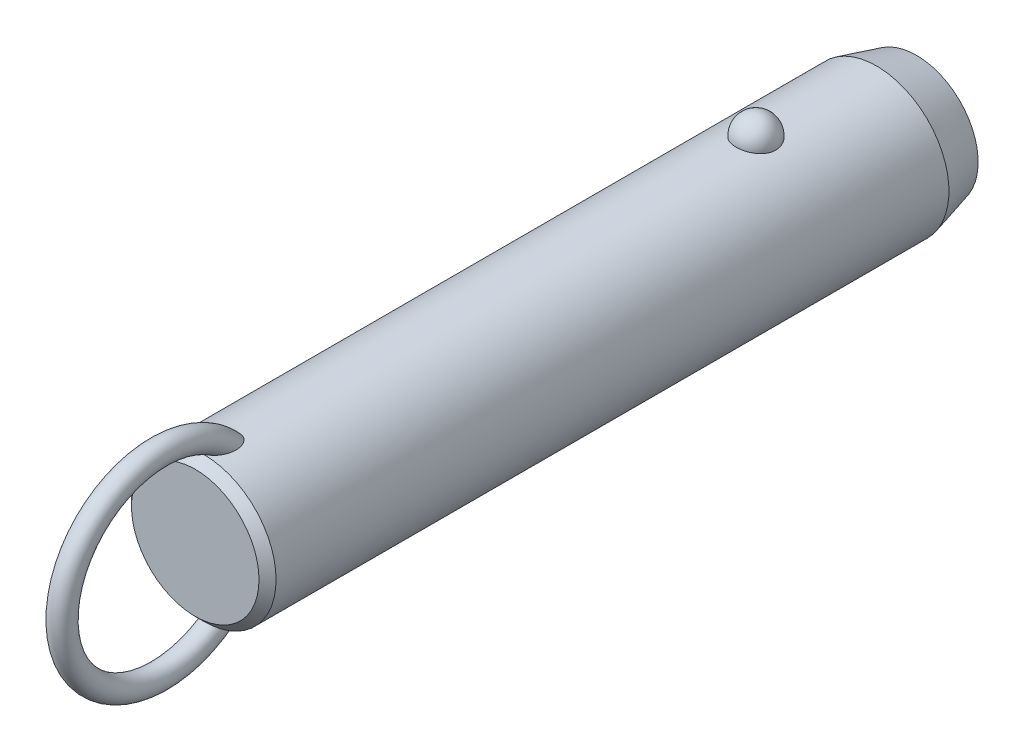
ISO-10303-21;
HEADER;
FILE_DESCRIPTION(('STEP AP214'),'2;1');
FILE_NAME('part.step','',(''),(''),'','','');
FILE_SCHEMA(('AUTOMOTIVE_DESIGN { 1 0 10303 214 1 1 1 1 }'));
ENDSEC;
DATA;
#1=APPLICATION_CONTEXT('core data for automotive mechanical design processes');
#2=APPLICATION_PROTOCOL_DEFINITION('international standard','automotive_design',2000,#1);
#3=PRODUCT_CONTEXT('',#1,'mechanical');
#4=PRODUCT('Part','Part','',(#3));
#5=PRODUCT_RELATED_PRODUCT_CATEGORY('part','',(#4));
#6=PRODUCT_DEFINITION_FORMATION('','',#4);
#7=PRODUCT_DEFINITION_CONTEXT('part definition',#1,'design');
#8=PRODUCT_DEFINITION('design','',#6,#7);
#9=PRODUCT_DEFINITION_SHAPE('','',#8);
#10=(LENGTH_UNIT() NAMED_UNIT(*) SI_UNIT(.MILLI.,.METRE.));
#11=(NAMED_UNIT(*) PLANE_ANGLE_UNIT() SI_UNIT($,.RADIAN.));
#12=(NAMED_UNIT(*) SI_UNIT($,.STERADIAN.) SOLID_ANGLE_UNIT());
#13=UNCERTAINTY_MEASURE_WITH_UNIT(LENGTH_MEASURE(1.E-05),#10,'distance_accuracy_value','');
#14=(GEOMETRIC_REPRESENTATION_CONTEXT(3) GLOBAL_UNCERTAINTY_ASSIGNED_CONTEXT((#13)) GLOBAL_UNIT_ASSIGNED_CONTEXT((#10,
#11,#12)) REPRESENTATION_CONTEXT('',''));
#15=CARTESIAN_POINT('',(0.,0.,0.));
#16=DIRECTION('',(0.,0.,1.));
#17=DIRECTION('',(1.,0.,0.));
#18=AXIS2_PLACEMENT_3D('',#15,#16,#17);
#19=CARTESIAN_POINT('',(0.,0.,82.3));
#20=DIRECTION('',(0.,0.,-1.));
#21=DIRECTION('',(-1.,0.,0.));
#22=AXIS2_PLACEMENT_3D('',#19,#20,#21);
#23=CYLINDRICAL_SURFACE('',#22,12.7);
#24=CARTESIAN_POINT('',(3.46661256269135,12.2177165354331,-3.5));
#25=CARTESIAN_POINT('',(3.4666090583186,12.2177194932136,-3.30432790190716));
#26=CARTESIAN_POINT('',(3.45063567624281,12.2222841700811,-3.10861112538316));
#27=CARTESIAN_POINT('',(3.38712451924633,12.2400345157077,-2.72271899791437));
#28=CARTESIAN_POINT('',(3.33957415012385,12.2532236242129,-2.53254588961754));
#29=CARTESIAN_POINT('',(3.2141234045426,12.286724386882,-2.16324948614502));
#30=CARTESIAN_POINT('',(3.13623639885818,12.3070329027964,-1.98412136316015));
#31=CARTESIAN_POINT('',(2.95205930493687,12.3525018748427,-1.64180592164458));
#32=CARTESIAN_POINT('',(2.84577003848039,12.3776621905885,-1.47861814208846));
#33=CARTESIAN_POINT('',(2.60688050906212,12.4301712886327,-1.17190583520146));
#34=CARTESIAN_POINT('',(2.47415697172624,12.4575299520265,-1.02847897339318));
#35=CARTESIAN_POINT('',(2.18615174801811,12.5112810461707,-0.766177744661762));
#36=CARTESIAN_POINT('',(2.03087002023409,12.5376734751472,-0.64730342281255));
#37=CARTESIAN_POINT('',(1.70237334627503,12.5864761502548,-0.437732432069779));
#38=CARTESIAN_POINT('',(1.52920948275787,12.6088972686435,-0.346958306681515));
#39=CARTESIAN_POINT('',(1.16944170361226,12.6473352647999,-0.195750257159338));
#40=CARTESIAN_POINT('',(0.982839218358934,12.663352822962,-0.135313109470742));
#41=CARTESIAN_POINT('',(0.604961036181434,12.6869706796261,-0.0473241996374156));
#42=CARTESIAN_POINT('',(0.41382314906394,12.6947125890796,-0.0192185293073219));
#43=CARTESIAN_POINT('',(0.0293827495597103,12.7014203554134,0.0051725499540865));
#44=CARTESIAN_POINT('',(-0.163919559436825,12.7003870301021,0.00146092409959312));
#45=CARTESIAN_POINT('',(-0.544374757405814,12.689735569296,-0.0373939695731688));
#46=CARTESIAN_POINT('',(-0.731575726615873,12.6802364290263,-0.0721015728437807));
#47=CARTESIAN_POINT('',(-1.09733277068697,12.6538333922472,-0.171364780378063));
#48=CARTESIAN_POINT('',(-1.27588869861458,12.6369293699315,-0.235920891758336));
#49=CARTESIAN_POINT('',(-1.6204698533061,12.5973946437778,-0.393548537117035));
#50=CARTESIAN_POINT('',(-1.78641865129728,12.5747321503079,-0.486778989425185));
#51=CARTESIAN_POINT('',(-2.10030671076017,12.5261316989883,-0.699110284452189));
#52=CARTESIAN_POINT('',(-2.24824419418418,12.5001934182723,-0.818213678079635));
#53=CARTESIAN_POINT('',(-2.52491489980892,12.4472906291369,-1.08157124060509));
#54=CARTESIAN_POINT('',(-2.65324222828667,12.4203160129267,-1.22624992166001));
#55=CARTESIAN_POINT('',(-2.88410007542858,12.3687509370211,-1.53528325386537));
#56=CARTESIAN_POINT('',(-2.98662883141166,12.3441606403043,-1.69963924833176));
#57=CARTESIAN_POINT('',(-3.16432417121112,12.2998199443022,-2.04548497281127));
#58=CARTESIAN_POINT('',(-3.23917525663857,12.2801261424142,-2.22714424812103));
#59=CARTESIAN_POINT('',(-3.35800573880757,12.248167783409,-2.6009138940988));
#60=CARTESIAN_POINT('',(-3.4019860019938,12.2359030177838,-2.79302397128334));
#61=CARTESIAN_POINT('',(-3.45784812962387,12.2202347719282,-3.18140279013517));
#62=CARTESIAN_POINT('',(-3.46986123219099,12.2167950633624,-3.37765118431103));
#63=CARTESIAN_POINT('',(-3.46186273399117,12.2190638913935,-3.76943689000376));
#64=CARTESIAN_POINT('',(-3.44185196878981,12.2247721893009,-3.96497421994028));
#65=CARTESIAN_POINT('',(-3.37048652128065,12.2446381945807,-4.34881728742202));
#66=CARTESIAN_POINT('',(-3.31928253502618,12.2587552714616,-4.53715319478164));
#67=CARTESIAN_POINT('',(-3.18693461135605,12.2938237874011,-4.90231727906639));
#68=CARTESIAN_POINT('',(-3.1057895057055,12.3147754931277,-5.07914500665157));
#69=CARTESIAN_POINT('',(-2.91506431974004,12.3613125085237,-5.41732059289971));
#70=CARTESIAN_POINT('',(-2.80533587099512,12.3869217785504,-5.57858147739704));
#71=CARTESIAN_POINT('',(-2.560414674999,12.4398525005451,-5.88013283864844));
#72=CARTESIAN_POINT('',(-2.42522099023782,12.4671740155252,-6.02042254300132));
#73=CARTESIAN_POINT('',(-2.1323357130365,12.5205965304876,-6.27662798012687));
#74=CARTESIAN_POINT('',(-1.97456596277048,12.5466928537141,-6.3924554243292));
#75=CARTESIAN_POINT('',(-1.64115839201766,12.5946384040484,-6.59583547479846));
#76=CARTESIAN_POINT('',(-1.46552179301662,12.6164879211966,-6.68339001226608));
#77=CARTESIAN_POINT('',(-1.10356050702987,12.6532533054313,-6.82682153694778));
#78=CARTESIAN_POINT('',(-0.9173913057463,12.6682500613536,-6.8830698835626));
#79=CARTESIAN_POINT('',(-0.537836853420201,12.6900288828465,-6.96386887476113));
#80=CARTESIAN_POINT('',(-0.344452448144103,12.6968119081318,-6.9884232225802));
#81=CARTESIAN_POINT('',(0.0402577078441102,12.7013667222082,-7.00496469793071));
#82=CARTESIAN_POINT('',(0.231556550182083,12.6993008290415,-6.99753844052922));
#83=CARTESIAN_POINT('',(0.610105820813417,12.6867505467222,-6.9516636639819));
#84=CARTESIAN_POINT('',(0.797356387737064,12.6762664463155,-6.913216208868));
#85=CARTESIAN_POINT('',(1.16186657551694,12.6480587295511,-6.80658431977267));
#86=CARTESIAN_POINT('',(1.33915951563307,12.6303611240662,-6.73850666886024));
#87=CARTESIAN_POINT('',(1.67968518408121,12.5896027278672,-6.5745087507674));
#88=CARTESIAN_POINT('',(1.84291705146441,12.5665416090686,-6.47858678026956));
#89=CARTESIAN_POINT('',(2.15340192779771,12.5171072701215,-6.25982455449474));
#90=CARTESIAN_POINT('',(2.30037831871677,12.4906895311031,-6.13660186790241));
#91=CARTESIAN_POINT('',(2.5717412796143,12.4376567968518,-5.86739587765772));
#92=CARTESIAN_POINT('',(2.69612388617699,12.4110417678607,-5.72140858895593));
#93=CARTESIAN_POINT('',(2.92107785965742,12.360051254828,-5.40794137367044));
#94=CARTESIAN_POINT('',(3.02121329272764,12.3357209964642,-5.24014110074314));
#95=CARTESIAN_POINT('',(3.19236291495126,12.2925446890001,-4.88969865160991));
#96=CARTESIAN_POINT('',(3.26338839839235,12.2736965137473,-4.70706226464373));
#97=CARTESIAN_POINT('',(3.36788038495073,12.245404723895,-4.35469510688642));
#98=CARTESIAN_POINT('',(3.40484026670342,12.2351018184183,-4.18605935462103));
#99=CARTESIAN_POINT('',(3.45420764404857,12.2212564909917,-3.84496058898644));
#100=CARTESIAN_POINT('',(3.46661565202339,12.2177139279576,-3.67249765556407));
#101=CARTESIAN_POINT('',(3.46661256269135,12.2177165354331,-3.5));
#102=B_SPLINE_CURVE_WITH_KNOTS('',3,(#24,#25,#26,#27,#28,#29,#30,#31,#32,#33,#34,#35,#36,#37,
#38,#39,#40,#41,#42,#43,#44,#45,#46,#47,#48,#49,#50,#51,#52,#53,#54,#55,#56,#57,#58,#59,#60,#61,
#62,#63,#64,#65,#66,#67,#68,#69,#70,#71,#72,#73,#74,#75,#76,#77,#78,#79,#80,#81,#82,#83,#84,#85,
#86,#87,#88,#89,#90,#91,#92,#93,#94,#95,#96,#97,#98,#99,#100,#101),.UNSPECIFIED.,.T.,.F.,(4,2,2,
2,2,2,2,2,2,2,2,2,2,2,2,2,2,2,2,2,2,2,2,2,2,2,2,2,2,2,2,2,2,2,2,2,2,2,4),(0.,0.586396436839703,
1.17302689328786,1.7593990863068,2.34575431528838,2.93491084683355,3.52406845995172,
4.11158733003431,4.69904375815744,5.2762784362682,5.85345931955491,6.42265312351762,
6.99185659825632,7.56427334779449,8.136746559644,8.71981013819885,9.3029135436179,
9.89247258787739,10.4820150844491,11.0691335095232,11.6562366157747,12.2405256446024,
12.8248374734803,13.412244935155,13.9996740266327,14.5891883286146,15.1786623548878,
15.7609861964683,16.3432419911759,16.9148635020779,17.4864654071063,18.0560241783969,
18.6256177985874,19.2037609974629,19.7820055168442,20.3699810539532,20.957728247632,
21.4746855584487,21.9916320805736),.UNSPECIFIED.);
#103=CARTESIAN_POINT('',(3.46661256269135,12.2177165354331,-3.5));
#104=VERTEX_POINT('',#103);
#105=EDGE_CURVE('E41',#104,#104,#102,.T.);
#106=ORIENTED_EDGE('',*,*,#105,.T.);
#107=EDGE_LOOP('',(#106));
#108=FACE_BOUND('',#107,.T.);
#109=CARTESIAN_POINT('',(0.,0.,93.5));
#110=DIRECTION('',(0.,0.,1.));
#111=DIRECTION('',(1.,0.,0.));
#112=AXIS2_PLACEMENT_3D('',#109,#110,#111);
#113=CIRCLE('',#112,12.7);
#114=CARTESIAN_POINT('',(12.7,0.,93.5));
#115=VERTEX_POINT('',#114);
#116=EDGE_CURVE('E10',#115,#115,#113,.F.);
#117=ORIENTED_EDGE('',*,*,#116,.T.);
#118=EDGE_LOOP('',(#117));
#119=FACE_BOUND('',#118,.T.);
#120=CARTESIAN_POINT('',(-0.548122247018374,-12.6881662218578,87.2432187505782));
#121=CARTESIAN_POINT('',(-0.64886572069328,-12.6838128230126,87.277926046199));
#122=CARTESIAN_POINT('',(-0.746398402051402,-12.6783867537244,87.3220428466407));
#123=CARTESIAN_POINT('',(-0.93212506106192,-12.666091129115,87.4267647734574));
#124=CARTESIAN_POINT('',(-1.02030388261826,-12.6592192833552,87.487396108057));
#125=CARTESIAN_POINT('',(-1.18487740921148,-12.6448747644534,87.621847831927));
#126=CARTESIAN_POINT('',(-1.26134296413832,-12.637406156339,87.6955825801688));
#127=CARTESIAN_POINT('',(-1.4023120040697,-12.6225412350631,87.8536045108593));
#128=CARTESIAN_POINT('',(-1.46681470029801,-12.6151449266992,87.9378923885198));
#129=CARTESIAN_POINT('',(-1.60714786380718,-12.5981718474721,88.1496577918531));
#130=CARTESIAN_POINT('',(-1.67725126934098,-12.588900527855,88.2809624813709));
#131=CARTESIAN_POINT('',(-1.79536591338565,-12.5725964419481,88.5532471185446));
#132=CARTESIAN_POINT('',(-1.84333535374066,-12.5655679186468,88.6942447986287));
#133=CARTESIAN_POINT('',(-1.93422576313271,-12.5519624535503,89.0376455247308));
#134=CARTESIAN_POINT('',(-1.96788773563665,-12.5466298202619,89.2425578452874));
#135=CARTESIAN_POINT('',(-1.9941399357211,-12.542463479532,89.5517600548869));
#136=CARTESIAN_POINT('',(-1.99883864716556,-12.5417153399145,89.6552987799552));
#137=CARTESIAN_POINT('',(-2.00078003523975,-12.5414074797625,89.8624512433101));
#138=CARTESIAN_POINT('',(-1.99802449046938,-12.5418474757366,89.9660649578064));
#139=CARTESIAN_POINT('',(-1.98336733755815,-12.5441750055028,90.2103207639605));
#140=CARTESIAN_POINT('',(-1.96851430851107,-12.5465291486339,90.350780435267));
#141=CARTESIAN_POINT('',(-1.92707089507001,-12.5529612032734,90.629960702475));
#142=CARTESIAN_POINT('',(-1.900474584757,-12.5570399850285,90.7686803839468));
#143=CARTESIAN_POINT('',(-1.83619120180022,-12.5666008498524,91.0434113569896));
#144=CARTESIAN_POINT('',(-1.79850828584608,-12.57208240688,91.1794236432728));
#145=CARTESIAN_POINT('',(-1.71223796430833,-12.5841228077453,91.4478421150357));
#146=CARTESIAN_POINT('',(-1.6636567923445,-12.5906810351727,91.5802503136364));
#147=CARTESIAN_POINT('',(-1.57804503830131,-12.6016176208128,91.7854887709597));
#148=CARTESIAN_POINT('',(-1.54477252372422,-12.6057501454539,91.8599149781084));
#149=CARTESIAN_POINT('',(-1.47424480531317,-12.6141930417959,92.0068393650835));
#150=CARTESIAN_POINT('',(-1.43699041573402,-12.6185033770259,92.0793379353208));
#151=CARTESIAN_POINT('',(-1.35825795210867,-12.6272207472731,92.2218926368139));
#152=CARTESIAN_POINT('',(-1.31678520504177,-12.6316276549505,92.2919517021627));
#153=CARTESIAN_POINT('',(-1.22917793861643,-12.6404532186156,92.4290705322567));
#154=CARTESIAN_POINT('',(-1.18304514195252,-12.6448718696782,92.4961313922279));
#155=CARTESIAN_POINT('',(-1.07246411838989,-12.6547893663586,92.6438741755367));
#156=CARTESIAN_POINT('',(-1.00642239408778,-12.6602600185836,92.7233844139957));
#157=CARTESIAN_POINT('',(-0.864441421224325,-12.6707460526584,92.8731698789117));
#158=CARTESIAN_POINT('',(-0.788516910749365,-12.6757620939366,92.9434585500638));
#159=CARTESIAN_POINT('',(-0.652215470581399,-12.6833591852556,93.0486801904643));
#160=CARTESIAN_POINT('',(-0.594982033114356,-12.6861973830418,93.0876241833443));
#161=CARTESIAN_POINT('',(-0.475269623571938,-12.6912445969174,93.1564899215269));
#162=CARTESIAN_POINT('',(-0.412800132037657,-12.6934547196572,93.1864275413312));
#163=CARTESIAN_POINT('',(-0.295749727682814,-12.6966636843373,93.2297565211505));
#164=CARTESIAN_POINT('',(-0.241949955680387,-12.6978134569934,93.2452188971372));
#165=CARTESIAN_POINT('',(-0.132508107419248,-12.6994261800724,93.2668845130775));
#166=CARTESIAN_POINT('',(-0.0768679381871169,-12.6998898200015,93.2730970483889));
#167=CARTESIAN_POINT('',(0.0347696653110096,-12.7000752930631,93.2755838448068));
#168=CARTESIAN_POINT('',(0.0907676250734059,-12.6997954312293,93.2718353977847));
#169=CARTESIAN_POINT('',(0.201283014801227,-12.6985255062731,93.2547883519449));
#170=CARTESIAN_POINT('',(0.255799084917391,-12.6975348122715,93.2414812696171));
#171=CARTESIAN_POINT('',(0.376042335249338,-12.6946091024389,93.2020379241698));
#172=CARTESIAN_POINT('',(0.440950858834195,-12.6924943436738,93.1734492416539));
#173=CARTESIAN_POINT('',(0.565350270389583,-12.6875639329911,93.1063234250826));
#174=CARTESIAN_POINT('',(0.624828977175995,-12.6847467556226,93.0677646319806));
#175=CARTESIAN_POINT('',(0.774116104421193,-12.6767252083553,92.956949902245));
#176=CARTESIAN_POINT('',(0.859449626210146,-12.6711344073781,92.8787605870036));
#177=CARTESIAN_POINT('',(1.01789440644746,-12.6593922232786,92.710943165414));
#178=CARTESIAN_POINT('',(1.09096902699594,-12.653239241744,92.6212821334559));
#179=CARTESIAN_POINT('',(1.22268793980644,-12.6411674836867,92.4402658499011));
#180=CARTESIAN_POINT('',(1.28193986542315,-12.6352572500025,92.349345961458));
#181=CARTESIAN_POINT('',(1.39259777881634,-12.6235401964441,92.1627929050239));
#182=CARTESIAN_POINT('',(1.44399707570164,-12.6177334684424,92.0671558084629));
#183=CARTESIAN_POINT('',(1.53972870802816,-12.6064093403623,91.8722738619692));
#184=CARTESIAN_POINT('',(1.58405262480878,-12.6008922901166,91.7730248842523));
#185=CARTESIAN_POINT('',(1.66600705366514,-12.5903187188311,91.5717727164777));
#186=CARTESIAN_POINT('',(1.70363651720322,-12.5852622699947,91.4697690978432));
#187=CARTESIAN_POINT('',(1.7754537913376,-12.5753406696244,91.2543580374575));
#188=CARTESIAN_POINT('',(1.80903453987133,-12.5705328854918,91.140745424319));
#189=CARTESIAN_POINT('',(1.86844163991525,-12.5618400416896,90.9114575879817));
#190=CARTESIAN_POINT('',(1.89426665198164,-12.5579551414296,90.7957820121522));
#191=CARTESIAN_POINT('',(1.93785464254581,-12.5513030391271,90.5630072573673));
#192=CARTESIAN_POINT('',(1.95562640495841,-12.5485346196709,90.4459097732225));
#193=CARTESIAN_POINT('',(1.98264463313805,-12.5442934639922,90.2107473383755));
#194=CARTESIAN_POINT('',(1.99189298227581,-12.5428204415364,90.0926826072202));
#195=CARTESIAN_POINT('',(2.00416068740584,-12.540871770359,89.7806225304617));
#196=CARTESIAN_POINT('',(1.99944433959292,-12.541631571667,89.586229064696));
#197=CARTESIAN_POINT('',(1.96113755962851,-12.5476846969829,89.2003095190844));
#198=CARTESIAN_POINT('',(1.92758341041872,-12.5529723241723,89.0087801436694));
#199=CARTESIAN_POINT('',(1.83934342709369,-12.5661532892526,88.6822728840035));
#200=CARTESIAN_POINT('',(1.79215440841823,-12.5730485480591,88.5452499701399));
#201=CARTESIAN_POINT('',(1.67676242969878,-12.588958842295,88.2804459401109));
#202=CARTESIAN_POINT('',(1.60859050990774,-12.597970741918,88.1526515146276));
#203=CARTESIAN_POINT('',(1.46583832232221,-12.6152829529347,87.9358006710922));
#204=CARTESIAN_POINT('',(1.39525727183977,-12.6233659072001,87.8441050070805));
#205=CARTESIAN_POINT('',(1.23992594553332,-12.6395676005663,87.6734854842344));
#206=CARTESIAN_POINT('',(1.15517932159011,-12.6476863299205,87.5945583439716));
#207=CARTESIAN_POINT('',(0.971995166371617,-12.6630846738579,87.4526438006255));
#208=CARTESIAN_POINT('',(0.873456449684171,-12.6703572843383,87.3897849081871));
#209=CARTESIAN_POINT('',(0.665847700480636,-12.6829569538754,87.2844870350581));
#210=CARTESIAN_POINT('',(0.556784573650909,-12.688285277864,87.2420347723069));
#211=CARTESIAN_POINT('',(0.347338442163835,-12.6956226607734,87.1844434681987));
#212=CARTESIAN_POINT('',(0.247759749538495,-12.6979816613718,87.1663996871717));
#213=CARTESIAN_POINT('',(0.0470218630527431,-12.7003077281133,87.148600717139));
#214=CARTESIAN_POINT('',(-0.0541350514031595,-12.7002779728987,87.1488212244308));
#215=CARTESIAN_POINT('',(-0.221414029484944,-12.6982482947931,87.1643639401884));
#216=CARTESIAN_POINT('',(-0.288055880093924,-12.6969033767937,87.1746662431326));
#217=CARTESIAN_POINT('',(-0.419599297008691,-12.6932369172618,87.2031348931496));
#218=CARTESIAN_POINT('',(-0.484501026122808,-12.6909154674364,87.2213005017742));
#219=CARTESIAN_POINT('',(-0.548122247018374,-12.6881662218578,87.2432187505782));
#220=B_SPLINE_CURVE_WITH_KNOTS('',3,(#120,#121,#122,#123,#124,#125,#126,#127,#128,#129,#130,
#131,#132,#133,#134,#135,#136,#137,#138,#139,#140,#141,#142,#143,#144,#145,#146,#147,#148,#149,
#150,#151,#152,#153,#154,#155,#156,#157,#158,#159,#160,#161,#162,#163,#164,#165,#166,#167,#168,
#169,#170,#171,#172,#173,#174,#175,#176,#177,#178,#179,#180,#181,#182,#183,#184,#185,#186,#187,
#188,#189,#190,#191,#192,#193,#194,#195,#196,#197,#198,#199,#200,#201,#202,#203,#204,#205,#206,
#207,#208,#209,#210,#211,#212,#213,#214,#215,#216,#217,#218,#219),.UNSPECIFIED.,.T.,.F.,(4,2,2,
2,2,2,2,2,2,2,2,2,2,2,2,2,2,2,2,2,2,2,2,2,2,2,2,2,2,2,2,2,2,2,2,2,2,2,2,2,2,2,2,2,2,2,2,2,2,4),
(0.,0.319642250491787,0.639794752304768,0.957927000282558,1.27608021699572,1.72100165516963,
2.16675988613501,2.78630021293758,3.09705782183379,3.40774128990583,3.83096358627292,
4.25439969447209,4.67767724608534,5.1007133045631,5.34550297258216,5.59024267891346,
5.83467707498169,6.07902143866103,6.38891080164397,6.69834321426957,6.90560910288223,
7.11250749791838,7.279773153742,7.44687060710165,7.6143493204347,7.78197685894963,
7.99365544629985,8.20579780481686,8.55147335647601,8.89816429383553,9.22375138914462,
9.54961437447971,9.87586224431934,10.202161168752,10.5575872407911,10.9130746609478,
11.2681734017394,11.6231936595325,12.2046601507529,12.7853961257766,13.219164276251,
13.6522938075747,13.9989174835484,14.3454519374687,14.6946768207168,15.0436740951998,
15.3457513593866,15.6474266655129,15.8493051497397,16.0511646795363),.UNSPECIFIED.);
#221=CARTESIAN_POINT('',(-0.548122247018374,-12.6881662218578,87.2432187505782));
#222=VERTEX_POINT('',#221);
#223=EDGE_CURVE('E59',#222,#222,#220,.T.);
#224=ORIENTED_EDGE('',*,*,#223,.T.);
#225=EDGE_LOOP('',(#224));
#226=FACE_BOUND('',#225,.T.);
#227=CARTESIAN_POINT('',(-0.548122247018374,12.6881662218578,87.2432187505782));
#228=CARTESIAN_POINT('',(-0.459436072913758,12.6919968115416,87.212673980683));
#229=CARTESIAN_POINT('',(-0.368189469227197,12.6949996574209,87.1893913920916));
#230=CARTESIAN_POINT('',(-0.183024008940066,12.6990186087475,87.1584062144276));
#231=CARTESIAN_POINT('',(-0.0891049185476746,12.7000345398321,87.1507049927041));
#232=CARTESIAN_POINT('',(0.0987147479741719,12.6999636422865,87.1512455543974));
#233=CARTESIAN_POINT('',(0.192615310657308,12.6988761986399,87.1594920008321));
#234=CARTESIAN_POINT('',(0.377658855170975,12.6947211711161,87.1915515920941));
#235=CARTESIAN_POINT('',(0.468801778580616,12.6916535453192,87.2153650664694));
#236=CARTESIAN_POINT('',(0.645809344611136,12.6838788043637,87.2774565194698));
#237=CARTESIAN_POINT('',(0.731679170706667,12.6791733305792,87.315720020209));
#238=CARTESIAN_POINT('',(0.896315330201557,12.6686004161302,87.405120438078));
#239=CARTESIAN_POINT('',(0.975080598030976,12.6627328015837,87.4562592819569));
#240=CARTESIAN_POINT('',(1.12963655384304,12.6499161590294,87.5736782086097));
#241=CARTESIAN_POINT('',(1.20478673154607,12.6429194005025,87.6407929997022));
#242=CARTESIAN_POINT('',(1.34448241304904,12.6288282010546,87.7852250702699));
#243=CARTESIAN_POINT('',(1.40902173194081,12.621733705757,87.8625482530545));
#244=CARTESIAN_POINT('',(1.55208211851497,12.6050877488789,88.0592475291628));
#245=CARTESIAN_POINT('',(1.62510490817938,12.5957546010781,88.1826540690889));
#246=CARTESIAN_POINT('',(1.75019044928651,12.5789823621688,88.4397690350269));
#247=CARTESIAN_POINT('',(1.80221377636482,12.5715468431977,88.573496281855));
#248=CARTESIAN_POINT('',(1.90309965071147,12.5567434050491,88.8983516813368));
#249=CARTESIAN_POINT('',(1.94342317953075,12.5504515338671,89.0921611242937));
#250=CARTESIAN_POINT('',(1.99332997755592,12.5426147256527,89.4837881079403));
#251=CARTESIAN_POINT('',(2.00285305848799,12.5410790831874,89.6816127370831));
#252=CARTESIAN_POINT('',(1.99678999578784,12.5420407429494,90.0166427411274));
#253=CARTESIAN_POINT('',(1.98794117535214,12.5434564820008,90.1540428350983));
#254=CARTESIAN_POINT('',(1.95865119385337,12.5480641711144,90.4276394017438));
#255=CARTESIAN_POINT('',(1.9382043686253,12.5512569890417,90.5638352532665));
#256=CARTESIAN_POINT('',(1.88647896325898,12.5591352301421,90.8342493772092));
#257=CARTESIAN_POINT('',(1.85518800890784,12.5638223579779,90.9684652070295));
#258=CARTESIAN_POINT('',(1.78217886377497,12.5743868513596,91.2339362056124));
#259=CARTESIAN_POINT('',(1.74046509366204,12.5802637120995,91.3651926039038));
#260=CARTESIAN_POINT('',(1.66024095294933,12.5910571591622,91.5860855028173));
#261=CARTESIAN_POINT('',(1.62434772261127,12.5957535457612,91.6766904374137));
#262=CARTESIAN_POINT('',(1.5470900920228,12.6054762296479,91.8555125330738));
#263=CARTESIAN_POINT('',(1.50572681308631,12.6105024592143,91.9437301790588));
#264=CARTESIAN_POINT('',(1.41728020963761,12.620748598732,92.1169321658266));
#265=CARTESIAN_POINT('',(1.37021377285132,12.625967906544,92.2019251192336));
#266=CARTESIAN_POINT('',(1.2696962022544,12.6364721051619,92.3680072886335));
#267=CARTESIAN_POINT('',(1.21624929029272,12.6417569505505,92.4490990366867));
#268=CARTESIAN_POINT('',(1.10304413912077,12.6521331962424,92.6047027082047));
#269=CARTESIAN_POINT('',(1.04340936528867,12.657226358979,92.6793033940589));
#270=CARTESIAN_POINT('',(0.915919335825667,12.6670906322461,92.821324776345));
#271=CARTESIAN_POINT('',(0.848064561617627,12.6718617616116,92.8887458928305));
#272=CARTESIAN_POINT('',(0.717035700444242,12.67987711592,93.0006247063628));
#273=CARTESIAN_POINT('',(0.655526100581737,12.6832377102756,93.0469970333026));
#274=CARTESIAN_POINT('',(0.525985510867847,12.6892676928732,93.1296195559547));
#275=CARTESIAN_POINT('',(0.457969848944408,12.6919386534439,93.1658927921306));
#276=CARTESIAN_POINT('',(0.334859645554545,12.695691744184,93.2166572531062));
#277=CARTESIAN_POINT('',(0.281116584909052,12.6970073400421,93.2343733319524));
#278=CARTESIAN_POINT('',(0.17142581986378,12.6989609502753,93.2606429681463));
#279=CARTESIAN_POINT('',(0.11548082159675,12.699599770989,93.2692074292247));
#280=CARTESIAN_POINT('',(0.00272618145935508,12.7001251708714,93.2762531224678));
#281=CARTESIAN_POINT('',(-0.0540859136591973,12.7000089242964,93.2746964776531));
#282=CARTESIAN_POINT('',(-0.166544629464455,12.6990328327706,93.2616005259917));
#283=CARTESIAN_POINT('',(-0.222190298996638,12.6981724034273,93.2500533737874));
#284=CARTESIAN_POINT('',(-0.342018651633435,12.695562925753,93.2149128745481));
#285=CARTESIAN_POINT('',(-0.405606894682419,12.6936676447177,93.1893322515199));
#286=CARTESIAN_POINT('',(-0.527815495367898,12.6891754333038,93.1283111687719));
#287=CARTESIAN_POINT('',(-0.586425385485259,12.6865770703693,93.0928505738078));
#288=CARTESIAN_POINT('',(-0.731842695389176,12.6792129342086,92.9914960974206));
#289=CARTESIAN_POINT('',(-0.814709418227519,12.6740767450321,92.9200395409));
#290=CARTESIAN_POINT('',(-0.969101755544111,12.6632083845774,92.7658900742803));
#291=CARTESIAN_POINT('',(-1.04059564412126,12.6574746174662,92.6831668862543));
#292=CARTESIAN_POINT('',(-1.16981116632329,12.6461638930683,92.5158096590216));
#293=CARTESIAN_POINT('',(-1.22811369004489,12.6405994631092,92.4316166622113));
#294=CARTESIAN_POINT('',(-1.33743405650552,12.6295007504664,92.2585791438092));
#295=CARTESIAN_POINT('',(-1.38844577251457,12.6239664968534,92.1697307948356));
#296=CARTESIAN_POINT('',(-1.48400702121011,12.6130898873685,91.988389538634));
#297=CARTESIAN_POINT('',(-1.52854232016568,12.6077479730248,91.8958891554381));
#298=CARTESIAN_POINT('',(-1.6115011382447,12.5974127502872,91.7081607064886));
#299=CARTESIAN_POINT('',(-1.64992317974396,12.5924195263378,91.6129319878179));
#300=CARTESIAN_POINT('',(-1.73468589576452,12.581070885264,91.3828936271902));
#301=CARTESIAN_POINT('',(-1.77831261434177,12.5749388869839,91.2470661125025));
#302=CARTESIAN_POINT('',(-1.85439734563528,12.5639437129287,90.9722128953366));
#303=CARTESIAN_POINT('',(-1.88684994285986,12.5590811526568,90.8331856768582));
#304=CARTESIAN_POINT('',(-1.94008483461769,12.550968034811,90.5530923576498));
#305=CARTESIAN_POINT('',(-1.96088706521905,12.5477147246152,90.4120301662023));
#306=CARTESIAN_POINT('',(-1.99000539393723,12.5431291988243,90.1286689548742));
#307=CARTESIAN_POINT('',(-1.99832911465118,12.5417958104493,89.9863707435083));
#308=CARTESIAN_POINT('',(-2.00166624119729,12.5412674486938,89.6576271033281));
#309=CARTESIAN_POINT('',(-1.99178843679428,12.5428579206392,89.471088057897));
#310=CARTESIAN_POINT('',(-1.9445518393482,12.5502731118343,89.1016240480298));
#311=CARTESIAN_POINT('',(-1.90724032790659,12.5560905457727,88.9186934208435));
#312=CARTESIAN_POINT('',(-1.81330718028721,12.5699462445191,88.6048488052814));
#313=CARTESIAN_POINT('',(-1.76338820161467,12.5771273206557,88.4719105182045));
#314=CARTESIAN_POINT('',(-1.64305018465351,12.593414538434,88.2156813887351));
#315=CARTESIAN_POINT('',(-1.57265346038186,12.6025185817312,88.092380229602));
#316=CARTESIAN_POINT('',(-1.42634956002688,12.6198178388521,87.8835648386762));
#317=CARTESIAN_POINT('',(-1.35423772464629,12.6278405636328,87.7953846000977));
#318=CARTESIAN_POINT('',(-1.19645664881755,12.6437632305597,87.6321079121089));
#319=CARTESIAN_POINT('',(-1.11080536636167,12.6516633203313,87.5569944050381));
#320=CARTESIAN_POINT('',(-0.947219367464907,12.6648319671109,87.4378114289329));
#321=CARTESIAN_POINT('',(-0.871624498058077,12.670300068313,87.3905414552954));
#322=CARTESIAN_POINT('',(-0.714161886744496,12.6801492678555,87.3077413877));
#323=CARTESIAN_POINT('',(-0.632295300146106,12.684530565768,87.2722091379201));
#324=CARTESIAN_POINT('',(-0.548122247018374,12.6881662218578,87.2432187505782));
#325=B_SPLINE_CURVE_WITH_KNOTS('',3,(#227,#228,#229,#230,#231,#232,#233,#234,#235,#236,#237,
#238,#239,#240,#241,#242,#243,#244,#245,#246,#247,#248,#249,#250,#251,#252,#253,#254,#255,#256,
#257,#258,#259,#260,#261,#262,#263,#264,#265,#266,#267,#268,#269,#270,#271,#272,#273,#274,#275,
#276,#277,#278,#279,#280,#281,#282,#283,#284,#285,#286,#287,#288,#289,#290,#291,#292,#293,#294,
#295,#296,#297,#298,#299,#300,#301,#302,#303,#304,#305,#306,#307,#308,#309,#310,#311,#312,#313,
#314,#315,#316,#317,#318,#319,#320,#321,#322,#323,#324),.UNSPECIFIED.,.T.,.F.,(4,2,2,2,2,2,2,2,
2,2,2,2,2,2,2,2,2,2,2,2,2,2,2,2,2,2,2,2,2,2,2,2,2,2,2,2,2,2,2,2,2,2,2,2,2,2,2,2,4),(0.,
0.281328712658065,0.562682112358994,0.844117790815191,1.12555942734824,1.40671982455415,
1.68792232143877,1.98972294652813,2.29169886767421,2.72039860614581,3.14989948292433,
3.74084916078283,4.33295293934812,4.74554109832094,5.15833092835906,5.57159335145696,
5.98468079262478,6.27722775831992,6.56971484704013,6.86135609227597,7.15280542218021,
7.43927407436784,7.72572595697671,7.9563586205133,8.18646071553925,8.35559393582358,
8.52452541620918,8.69408946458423,8.86378678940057,9.06834348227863,9.27332014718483,
9.60010414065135,9.92778432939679,10.2350252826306,10.5425229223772,10.8506864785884,
11.1589244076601,11.5867893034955,12.0148612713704,12.4421984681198,12.8692745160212,
13.4279365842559,13.9856380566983,14.4107062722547,14.8353130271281,15.1765567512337,
15.5173516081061,15.7844129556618,16.051425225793),.UNSPECIFIED.);
#326=CARTESIAN_POINT('',(-0.548122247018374,12.6881662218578,87.2432187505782));
#327=VERTEX_POINT('',#326);
#328=EDGE_CURVE('E67',#327,#327,#325,.T.);
#329=ORIENTED_EDGE('',*,*,#328,.T.);
#330=EDGE_LOOP('',(#329));
#331=FACE_BOUND('',#330,.T.);
#332=CARTESIAN_POINT('',(0.,0.,-24.6999999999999));
#333=DIRECTION('',(0.,0.,-1.));
#334=DIRECTION('',(-1.,0.,0.));
#335=AXIS2_PLACEMENT_3D('',#332,#333,#334);
#336=CIRCLE('',#335,12.7);
#337=CARTESIAN_POINT('',(-12.7,0.,-24.6999999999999));
#338=VERTEX_POINT('',#337);
#339=EDGE_CURVE('E56',#338,#338,#336,.F.);
#340=ORIENTED_EDGE('',*,*,#339,.T.);
#341=EDGE_LOOP('',(#340));
#342=FACE_BOUND('',#341,.T.);
#343=ADVANCED_FACE('F37',(#108,#119,#226,#331,#342),#23,.T.);
#344=CARTESIAN_POINT('',(0.,0.,-31.7));
#345=DIRECTION('',(0.,0.,-1.));
#346=DIRECTION('',(-1.,0.,0.));
#347=AXIS2_PLACEMENT_3D('',#344,#345,#346);
#348=PLANE('',#347);
#349=CARTESIAN_POINT('',(0.,0.,-31.7));
#350=DIRECTION('',(0.,0.,-1.));
#351=DIRECTION('',(-1.,0.,0.));
#352=AXIS2_PLACEMENT_3D('',#349,#350,#351);
#353=CIRCLE('',#352,10.8243556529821);
#354=CARTESIAN_POINT('',(-10.8243556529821,0.,-31.7));
#355=VERTEX_POINT('',#354);
#356=EDGE_CURVE('E66',#355,#355,#353,.T.);
#357=ORIENTED_EDGE('',*,*,#356,.T.);
#358=EDGE_LOOP('',(#357));
#359=FACE_BOUND('',#358,.T.);
#360=ADVANCED_FACE('F85',(#359),#348,.T.);
#361=CARTESIAN_POINT('',(0.,0.,-31.7));
#362=DIRECTION('',(0.,0.,1.));
#363=DIRECTION('',(1.,0.,0.));
#364=AXIS2_PLACEMENT_3D('',#361,#362,#363);
#365=CONICAL_SURFACE('',#364,10.8243556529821,0.261799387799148);
#366=ORIENTED_EDGE('',*,*,#339,.F.);
#367=EDGE_LOOP('',(#366));
#368=FACE_BOUND('',#367,.T.);
#369=ORIENTED_EDGE('',*,*,#356,.F.);
#370=EDGE_LOOP('',(#369));
#371=FACE_BOUND('',#370,.T.);
#372=ADVANCED_FACE('F83',(#368,#371),#365,.T.);
#373=CARTESIAN_POINT('',(0.,0.,95.));
#374=DIRECTION('',(0.,0.,1.));
#375=DIRECTION('',(1.,0.,0.));
#376=AXIS2_PLACEMENT_3D('',#373,#374,#375);
#377=PLANE('',#376);
#378=CARTESIAN_POINT('',(0.,0.,95.));
#379=DIRECTION('',(0.,0.,1.));
#380=DIRECTION('',(1.,0.,0.));
#381=AXIS2_PLACEMENT_3D('',#378,#379,#380);
#382=CIRCLE('',#381,11.2);
#383=CARTESIAN_POINT('',(11.2,0.,95.));
#384=VERTEX_POINT('',#383);
#385=EDGE_CURVE('E50',#384,#384,#382,.T.);
#386=ORIENTED_EDGE('',*,*,#385,.T.);
#387=EDGE_LOOP('',(#386));
#388=FACE_BOUND('',#387,.T.);
#389=ADVANCED_FACE('F77',(#388),#377,.T.);
#390=CARTESIAN_POINT('',(0.,0.,101.35));
#391=DIRECTION('',(1.,0.,0.));
#392=DIRECTION('',(0.,0.,-1.));
#393=AXIS2_PLACEMENT_3D('',#390,#391,#392);
#394=TOROIDAL_SURFACE('',#393,17.05,2.);
#395=ORIENTED_EDGE('',*,*,#328,.F.);
#396=EDGE_LOOP('',(#395));
#397=FACE_BOUND('',#396,.T.);
#398=ORIENTED_EDGE('',*,*,#223,.F.);
#399=EDGE_LOOP('',(#398));
#400=FACE_BOUND('',#399,.T.);
#401=ADVANCED_FACE('F73',(#397,#400),#394,.T.);
#402=CARTESIAN_POINT('',(0.,0.,95.));
#403=DIRECTION('',(0.,0.,-1.));
#404=DIRECTION('',(-1.,0.,0.));
#405=AXIS2_PLACEMENT_3D('',#402,#403,#404);
#406=CONICAL_SURFACE('',#405,11.2,0.785398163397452);
#407=ORIENTED_EDGE('',*,*,#116,.F.);
#408=EDGE_LOOP('',(#407));
#409=FACE_BOUND('',#408,.T.);
#410=ORIENTED_EDGE('',*,*,#385,.F.);
#411=EDGE_LOOP('',(#410));
#412=FACE_BOUND('',#411,.T.);
#413=ADVANCED_FACE('F39',(#409,#412),#406,.T.);
#414=CARTESIAN_POINT('',(0.,12.7,-3.5));
#415=DIRECTION('',(0.,1.,0.));
#416=DIRECTION('',(0.,0.,-1.));
#417=AXIS2_PLACEMENT_3D('',#414,#415,#416);
#418=SPHERICAL_SURFACE('',#417,3.5);
#419=ORIENTED_EDGE('',*,*,#105,.F.);
#420=EDGE_LOOP('',(#419));
#421=FACE_BOUND('',#420,.T.);
#422=ADVANCED_FACE('F79',(#421),#418,.T.);
#423=CLOSED_SHELL('',(#343,#360,#372,#389,#401,#413,#422));
#424=MANIFOLD_SOLID_BREP('B2',#423);
#425=ADVANCED_BREP_SHAPE_REPRESENTATION('',(#18,#424),#14);
#426=SHAPE_DEFINITION_REPRESENTATION(#9,#425);
ENDSEC;
END-ISO-10303-21;
